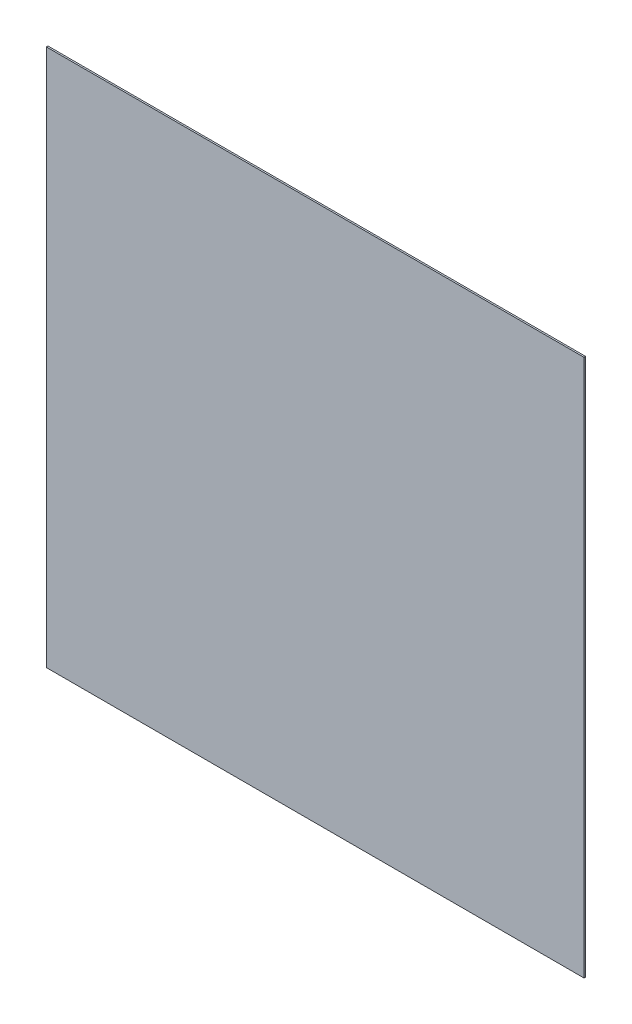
ISO-10303-21;
HEADER;
FILE_DESCRIPTION(('STEP AP214'),'2;1');
FILE_NAME('part.step','',(''),(''),'','','');
FILE_SCHEMA(('AUTOMOTIVE_DESIGN { 1 0 10303 214 1 1 1 1 }'));
ENDSEC;
DATA;
#1=APPLICATION_CONTEXT('core data for automotive mechanical design processes');
#2=APPLICATION_PROTOCOL_DEFINITION('international standard','automotive_design',2000,#1);
#3=PRODUCT_CONTEXT('',#1,'mechanical');
#4=PRODUCT('Part','Part','',(#3));
#5=PRODUCT_RELATED_PRODUCT_CATEGORY('part','',(#4));
#6=PRODUCT_DEFINITION_FORMATION('','',#4);
#7=PRODUCT_DEFINITION_CONTEXT('part definition',#1,'design');
#8=PRODUCT_DEFINITION('design','',#6,#7);
#9=PRODUCT_DEFINITION_SHAPE('','',#8);
#10=(LENGTH_UNIT() NAMED_UNIT(*) SI_UNIT(.MILLI.,.METRE.));
#11=(NAMED_UNIT(*) PLANE_ANGLE_UNIT() SI_UNIT($,.RADIAN.));
#12=(NAMED_UNIT(*) SI_UNIT($,.STERADIAN.) SOLID_ANGLE_UNIT());
#13=UNCERTAINTY_MEASURE_WITH_UNIT(LENGTH_MEASURE(1.E-05),#10,'distance_accuracy_value','');
#14=(GEOMETRIC_REPRESENTATION_CONTEXT(3) GLOBAL_UNCERTAINTY_ASSIGNED_CONTEXT((#13)) GLOBAL_UNIT_ASSIGNED_CONTEXT((#10,
#11,#12)) REPRESENTATION_CONTEXT('',''));
#15=CARTESIAN_POINT('',(0.,0.,0.));
#16=DIRECTION('',(0.,0.,1.));
#17=DIRECTION('',(1.,0.,0.));
#18=AXIS2_PLACEMENT_3D('',#15,#16,#17);
#19=CARTESIAN_POINT('',(0.,0.,3.));
#20=DIRECTION('',(1.,0.,0.));
#21=DIRECTION('',(0.,0.,-1.));
#22=AXIS2_PLACEMENT_3D('',#19,#20,#21);
#23=PLANE('',#22);
#24=DIRECTION('',(0.,-1.,0.));
#25=VECTOR('',#24,1.);
#26=CARTESIAN_POINT('',(0.,0.,0.));
#27=LINE('',#26,#25);
#28=CARTESIAN_POINT('',(0.,1000.,0.));
#29=VERTEX_POINT('',#28);
#30=CARTESIAN_POINT('',(0.,0.,0.));
#31=VERTEX_POINT('',#30);
#32=EDGE_CURVE('E96',#29,#31,#27,.T.);
#33=ORIENTED_EDGE('',*,*,#32,.T.);
#34=DIRECTION('',(0.,0.,-1.));
#35=VECTOR('',#34,1.);
#36=CARTESIAN_POINT('',(0.,0.,3.));
#37=LINE('',#36,#35);
#38=CARTESIAN_POINT('',(0.,0.,3.));
#39=VERTEX_POINT('',#38);
#40=EDGE_CURVE('E11',#39,#31,#37,.T.);
#41=ORIENTED_EDGE('',*,*,#40,.F.);
#42=DIRECTION('',(0.,-1.,0.));
#43=VECTOR('',#42,1.);
#44=CARTESIAN_POINT('',(0.,0.,3.));
#45=LINE('',#44,#43);
#46=CARTESIAN_POINT('',(0.,1000.,3.));
#47=VERTEX_POINT('',#46);
#48=EDGE_CURVE('E84',#47,#39,#45,.T.);
#49=ORIENTED_EDGE('',*,*,#48,.F.);
#50=DIRECTION('',(0.,0.,-1.));
#51=VECTOR('',#50,1.);
#52=CARTESIAN_POINT('',(0.,1000.,3.));
#53=LINE('',#52,#51);
#54=EDGE_CURVE('E92',#47,#29,#53,.T.);
#55=ORIENTED_EDGE('',*,*,#54,.T.);
#56=EDGE_LOOP('',(#33,#41,#49,#55));
#57=FACE_BOUND('',#56,.T.);
#58=ADVANCED_FACE('F33',(#57),#23,.F.);
#59=CARTESIAN_POINT('',(0.,0.,3.));
#60=DIRECTION('',(0.,1.,0.));
#61=DIRECTION('',(0.,0.,1.));
#62=AXIS2_PLACEMENT_3D('',#59,#60,#61);
#63=PLANE('',#62);
#64=DIRECTION('',(1.,0.,0.));
#65=VECTOR('',#64,1.);
#66=CARTESIAN_POINT('',(0.,0.,0.));
#67=LINE('',#66,#65);
#68=CARTESIAN_POINT('',(1000.,0.,0.));
#69=VERTEX_POINT('',#68);
#70=EDGE_CURVE('E88',#31,#69,#67,.T.);
#71=ORIENTED_EDGE('',*,*,#70,.T.);
#72=DIRECTION('',(0.,0.,-1.));
#73=VECTOR('',#72,1.);
#74=CARTESIAN_POINT('',(1000.,0.,3.));
#75=LINE('',#74,#73);
#76=CARTESIAN_POINT('',(1000.,0.,3.));
#77=VERTEX_POINT('',#76);
#78=EDGE_CURVE('E41',#77,#69,#75,.T.);
#79=ORIENTED_EDGE('',*,*,#78,.F.);
#80=DIRECTION('',(1.,0.,0.));
#81=VECTOR('',#80,1.);
#82=CARTESIAN_POINT('',(0.,0.,3.));
#83=LINE('',#82,#81);
#84=EDGE_CURVE('E79',#39,#77,#83,.T.);
#85=ORIENTED_EDGE('',*,*,#84,.F.);
#86=ORIENTED_EDGE('',*,*,#40,.T.);
#87=EDGE_LOOP('',(#71,#79,#85,#86));
#88=FACE_BOUND('',#87,.T.);
#89=ADVANCED_FACE('F87',(#88),#63,.F.);
#90=CARTESIAN_POINT('',(1000.,0.,3.));
#91=DIRECTION('',(-1.,0.,0.));
#92=DIRECTION('',(0.,0.,1.));
#93=AXIS2_PLACEMENT_3D('',#90,#91,#92);
#94=PLANE('',#93);
#95=DIRECTION('',(0.,1.,0.));
#96=VECTOR('',#95,1.);
#97=CARTESIAN_POINT('',(1000.,0.,0.));
#98=LINE('',#97,#96);
#99=CARTESIAN_POINT('',(1000.,1000.,0.));
#100=VERTEX_POINT('',#99);
#101=EDGE_CURVE('E66',#69,#100,#98,.T.);
#102=ORIENTED_EDGE('',*,*,#101,.T.);
#103=DIRECTION('',(0.,0.,-1.));
#104=VECTOR('',#103,1.);
#105=CARTESIAN_POINT('',(1000.,1000.,3.));
#106=LINE('',#105,#104);
#107=CARTESIAN_POINT('',(1000.,1000.,3.));
#108=VERTEX_POINT('',#107);
#109=EDGE_CURVE('E89',#108,#100,#106,.T.);
#110=ORIENTED_EDGE('',*,*,#109,.F.);
#111=DIRECTION('',(0.,1.,0.));
#112=VECTOR('',#111,1.);
#113=CARTESIAN_POINT('',(1000.,0.,3.));
#114=LINE('',#113,#112);
#115=EDGE_CURVE('E82',#77,#108,#114,.T.);
#116=ORIENTED_EDGE('',*,*,#115,.F.);
#117=ORIENTED_EDGE('',*,*,#78,.T.);
#118=EDGE_LOOP('',(#102,#110,#116,#117));
#119=FACE_BOUND('',#118,.T.);
#120=ADVANCED_FACE('F90',(#119),#94,.F.);
#121=CARTESIAN_POINT('',(0.,1000.,3.));
#122=DIRECTION('',(0.,-1.,0.));
#123=DIRECTION('',(0.,0.,-1.));
#124=AXIS2_PLACEMENT_3D('',#121,#122,#123);
#125=PLANE('',#124);
#126=DIRECTION('',(-1.,0.,0.));
#127=VECTOR('',#126,1.);
#128=CARTESIAN_POINT('',(0.,1000.,0.));
#129=LINE('',#128,#127);
#130=EDGE_CURVE('E72',#100,#29,#129,.T.);
#131=ORIENTED_EDGE('',*,*,#130,.T.);
#132=ORIENTED_EDGE('',*,*,#54,.F.);
#133=DIRECTION('',(-1.,0.,0.));
#134=VECTOR('',#133,1.);
#135=CARTESIAN_POINT('',(0.,1000.,3.));
#136=LINE('',#135,#134);
#137=EDGE_CURVE('E49',#108,#47,#136,.T.);
#138=ORIENTED_EDGE('',*,*,#137,.F.);
#139=ORIENTED_EDGE('',*,*,#109,.T.);
#140=EDGE_LOOP('',(#131,#132,#138,#139));
#141=FACE_BOUND('',#140,.T.);
#142=ADVANCED_FACE('F103',(#141),#125,.F.);
#143=CARTESIAN_POINT('',(0.,0.,3.));
#144=DIRECTION('',(0.,0.,-1.));
#145=DIRECTION('',(-1.,0.,0.));
#146=AXIS2_PLACEMENT_3D('',#143,#144,#145);
#147=PLANE('',#146);
#148=ORIENTED_EDGE('',*,*,#48,.T.);
#149=ORIENTED_EDGE('',*,*,#84,.T.);
#150=ORIENTED_EDGE('',*,*,#115,.T.);
#151=ORIENTED_EDGE('',*,*,#137,.T.);
#152=EDGE_LOOP('',(#148,#149,#150,#151));
#153=FACE_BOUND('',#152,.T.);
#154=ADVANCED_FACE('F80',(#153),#147,.F.);
#155=CARTESIAN_POINT('',(0.,0.,0.));
#156=DIRECTION('',(0.,0.,-1.));
#157=DIRECTION('',(-1.,0.,0.));
#158=AXIS2_PLACEMENT_3D('',#155,#156,#157);
#159=PLANE('',#158);
#160=ORIENTED_EDGE('',*,*,#32,.F.);
#161=ORIENTED_EDGE('',*,*,#130,.F.);
#162=ORIENTED_EDGE('',*,*,#101,.F.);
#163=ORIENTED_EDGE('',*,*,#70,.F.);
#164=EDGE_LOOP('',(#160,#161,#162,#163));
#165=FACE_BOUND('',#164,.T.);
#166=ADVANCED_FACE('F106',(#165),#159,.T.);
#167=CLOSED_SHELL('',(#58,#89,#120,#142,#154,#166));
#168=MANIFOLD_SOLID_BREP('B2',#167);
#169=ADVANCED_BREP_SHAPE_REPRESENTATION('',(#18,#168),#14);
#170=SHAPE_DEFINITION_REPRESENTATION(#9,#169);
ENDSEC;
END-ISO-10303-21;
